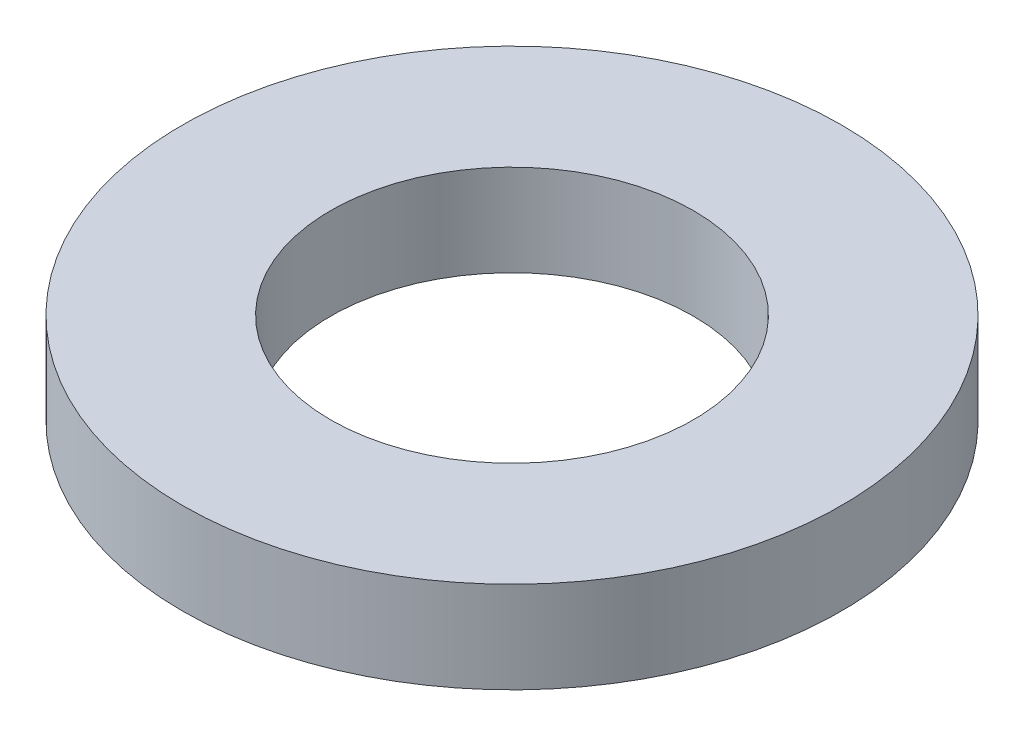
from build123d import *

# Parameters (mm, degrees)
SKETCH1_R      = 2.6543
SKETCH1_R_2    = 1.4605
EXTRUDE1_DEPTH = 0.7366


with BuildPart() as part:
    # Sketch1 → Extrude1 (new body)
    with BuildSketch(Plane(origin=(0, 0, 0), x_dir=(1, 0, 0), z_dir=(0, 1, 0))):
        with Locations(Location((0, 0, 0), (0, 0, 270))):
            Circle(SKETCH1_R)
        with Locations(Location((0, 0, 0), (0, 0, 270))):
            Circle(SKETCH1_R_2, mode=Mode.SUBTRACT)
    extrude(amount=EXTRUDE1_DEPTH)


solid = part.part
